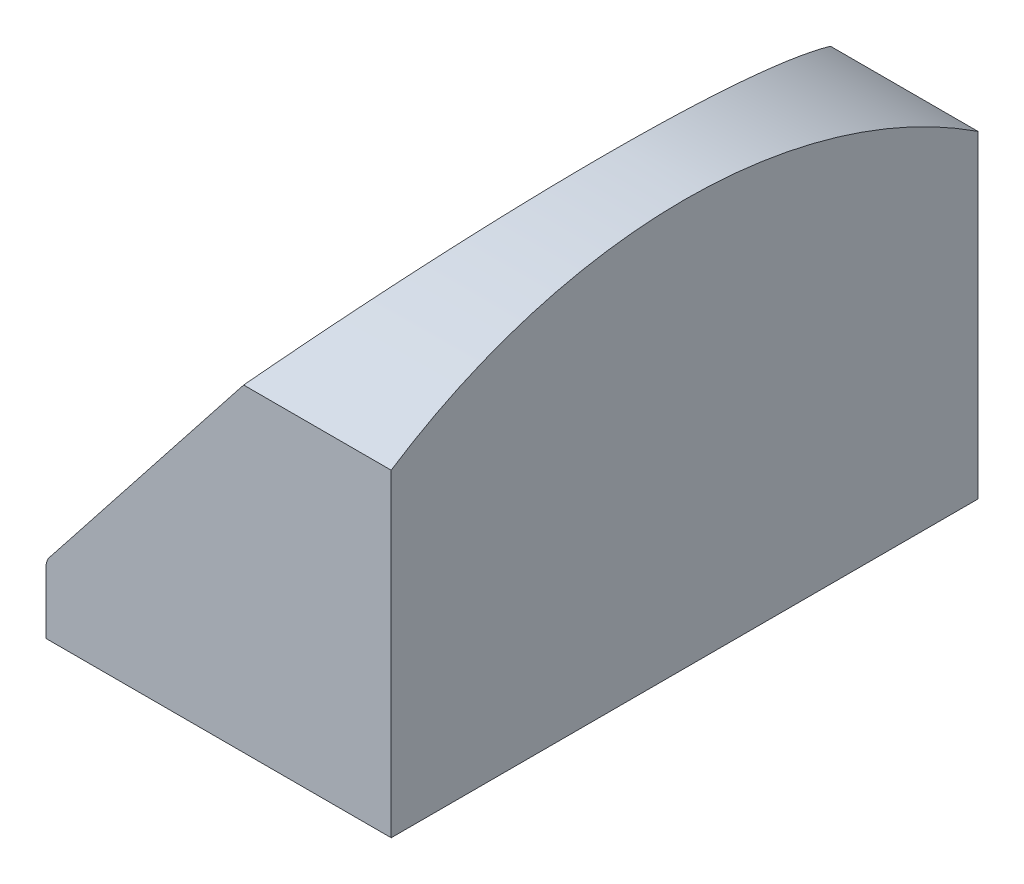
from build123d import *

# Parameters (mm, degrees)
EXTRUSION2_DEPTH        = 17
ENL_V_MAT_EXTRU_1_DEPTH = 23.983472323
ENL_V_MAT_EXTRU_2_DEPTH = 0.5
ESQUISSE5_W             = 0.510317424
ESQUISSE5_H             = 0.540336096
EXTRUSION3_DEPTH        = 0.2


with BuildPart() as part:
    # Esquisse2 → Extrusion2 (new body)
    with BuildSketch(Plane.XY):
        with BuildLine():
            Line((0, 0), (10, 0))
            Line((10, 0), (10, 11.8))
            Line((10, 11.8), (7.756949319, 11.8))
            Line((7.756949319, 11.8), (0.150035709, 2.147034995))
            ThreePointArc((0.150035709, 2.147034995), (0.03903246, 1.983600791), (0, 1.789928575))
            Line((0, 1.789928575), (0, 0))
        make_face()
    extrude(amount=EXTRUSION2_DEPTH)

    # Esquisse3 → Enl_v. mat.-Extru.1 (cut, through all)
    with BuildSketch(Plane(origin=(10, 0, 0), x_dir=(0, 0, -1), z_dir=(1, 0, 0))):
        with BuildLine():
            Line((-17, 9.222623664), (-18.558213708, 11.930915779))
            Line((-18.558213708, 11.930915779), (-17.64553696, 14.908967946))
            Line((-17.64553696, 14.908967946), (3.805830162, 12.247604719))
            Line((3.805830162, 12.247604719), (0, 9.222623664))
            ThreePointArc((0, 9.222623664), (-8.5, 11.760552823), (-17, 9.222623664))
        make_face()
    extrude(amount=-ENL_V_MAT_EXTRU_1_DEPTH, mode=Mode.SUBTRACT)

    # Esquisse4 → Enl_v. mat.-Extru.2 (cut)
    with BuildSketch(Plane(origin=(-0.951206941, 0.749588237, 0), x_dir=(0, 0, 1), z_dir=(-0.7854304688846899, 0.6189498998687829, 0))):
        with BuildLine():
            Line((16, 10.787760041), (16, 2.77921129))
            Line((16, 2.77921129), (1, 2.77921129))
            Line((1, 2.77921129), (1, 10.787760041))
            ThreePointArc((1, 10.787760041), (8.5, 13.365899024), (16, 10.787760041))
        make_face()
    extrude(amount=-ENL_V_MAT_EXTRU_2_DEPTH, mode=Mode.SUBTRACT)

    # Esquisse5 → Extrusion3 (add)
    with BuildSketch(Plane(origin=(-0.558491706, 0.440113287, 0), x_dir=(0, 0, 1), z_dir=(-0.7854304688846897, 0.618949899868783, 0))):
        with BuildLine():
            Line((12.261126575, 7.573940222), (11.416082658, 7.716134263))
            ThreePointArc((11.416082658, 7.716134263), (10.533450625, 8.279242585), (9.632237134, 7.746378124))
            Line((9.632237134, 7.746378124), (9.632237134, 5.265350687))
            Line((9.632237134, 5.265350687), (6.498637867, 5.265350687))
            Line((6.498637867, 5.265350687), (6.498637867, 7.746378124))
            Line((6.498637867, 7.746378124), (8.880424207, 7.746378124))
            ThreePointArc((8.880424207, 7.746378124), (10.618379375, 8.593451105), (12.261126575, 7.573940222))
        make_face()
        with Locations((7.884617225, 6.047261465)):
            Rectangle(ESQUISSE5_W, ESQUISSE5_H, mode=Mode.SUBTRACT)
    extrude(amount=EXTRUSION3_DEPTH)


solid = part.part
